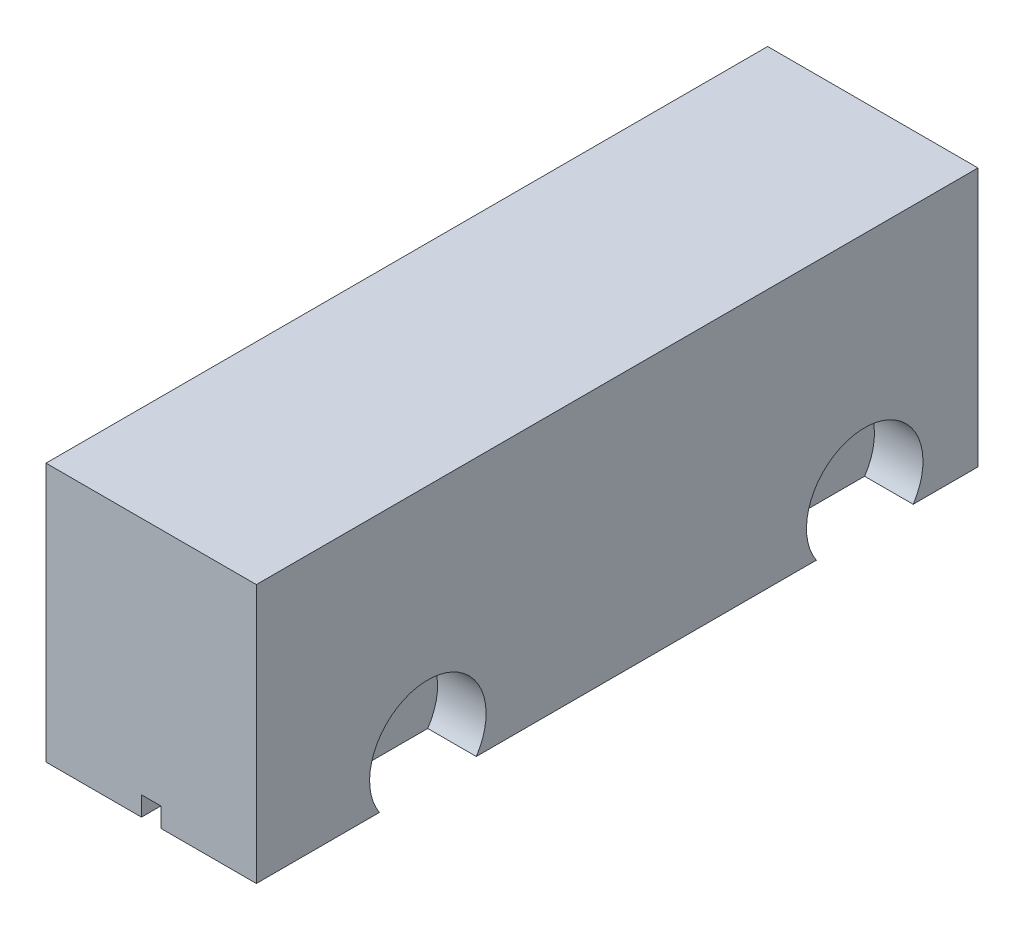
from build123d import *

# Parameters (mm, degrees)
SKETCH1_W               = 65
SKETCH1_H               = 80
BALSA_BLOCK_DEPTH       = 223
SKETCH2_W               = 6
SKETCH2_H               = 6
SCREW_EYE_SLOT_DEPTH    = 240.13437645
SKETCH4_R               = 1.525
AXLE_HOLE_CUT_OUT_DEPTH = 246.670511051
ESQUISSE1_R             = 18
ENL_V_MAT_EXTRU_1_DEPTH = 15
ENL_V_START             = -15
ESQUISSE2_R             = 18
ENL_V_MAT_EXTRU_2_DEPTH = 15


with BuildPart() as part:
    # Sketch1 → Balsa Block (new body)
    with BuildSketch(Plane.XY):
        with Locations((0, 40)):
            Rectangle(SKETCH1_W, SKETCH1_H)
    extrude(amount=BALSA_BLOCK_DEPTH)

    # Sketch2 → Screw Eye Slot (cut, through all)
    with BuildSketch(Plane.XY.offset(223)):
        with Locations((0, 3)):
            Rectangle(SKETCH2_W, SKETCH2_H)
    extrude(amount=-SCREW_EYE_SLOT_DEPTH, mode=Mode.SUBTRACT)

    # Sketch4 → Axle Hole Cut Out (cut, through all)
    with BuildSketch(Plane(origin=(32.5, 0, 0), x_dir=(0, 0, -1), z_dir=(1, 0, 0))):
        with Locations((-170, 10)):
            Circle(SKETCH4_R)
        with Locations((-35, 10)):
            Circle(SKETCH4_R)
    extrude(amount=-AXLE_HOLE_CUT_OUT_DEPTH, mode=Mode.SUBTRACT)

    # Esquisse1 → Enl_v. mat.-Extru.1 (cut)
    with BuildSketch(Plane(origin=(32.5, 0, 0), x_dir=(0, 0, -1), z_dir=(1, 0, 0))):
        with Locations((-170, 10)):
            Circle(ESQUISSE1_R)
        with Locations((-35, 10)):
            Circle(ESQUISSE1_R)
    extrude(amount=-ENL_V_MAT_EXTRU_1_DEPTH, mode=Mode.SUBTRACT)

    # Esquisse2 → Enl_v. mat.-Extru.2 (cut)
    with BuildSketch(Plane.ZY.offset(32.5).offset(ENL_V_START)):
        with Locations((35, 10)):
            Circle(ESQUISSE2_R)
        with Locations((170, 10)):
            Circle(ESQUISSE2_R)
    extrude(amount=ENL_V_MAT_EXTRU_2_DEPTH, mode=Mode.SUBTRACT)


solid = part.part
